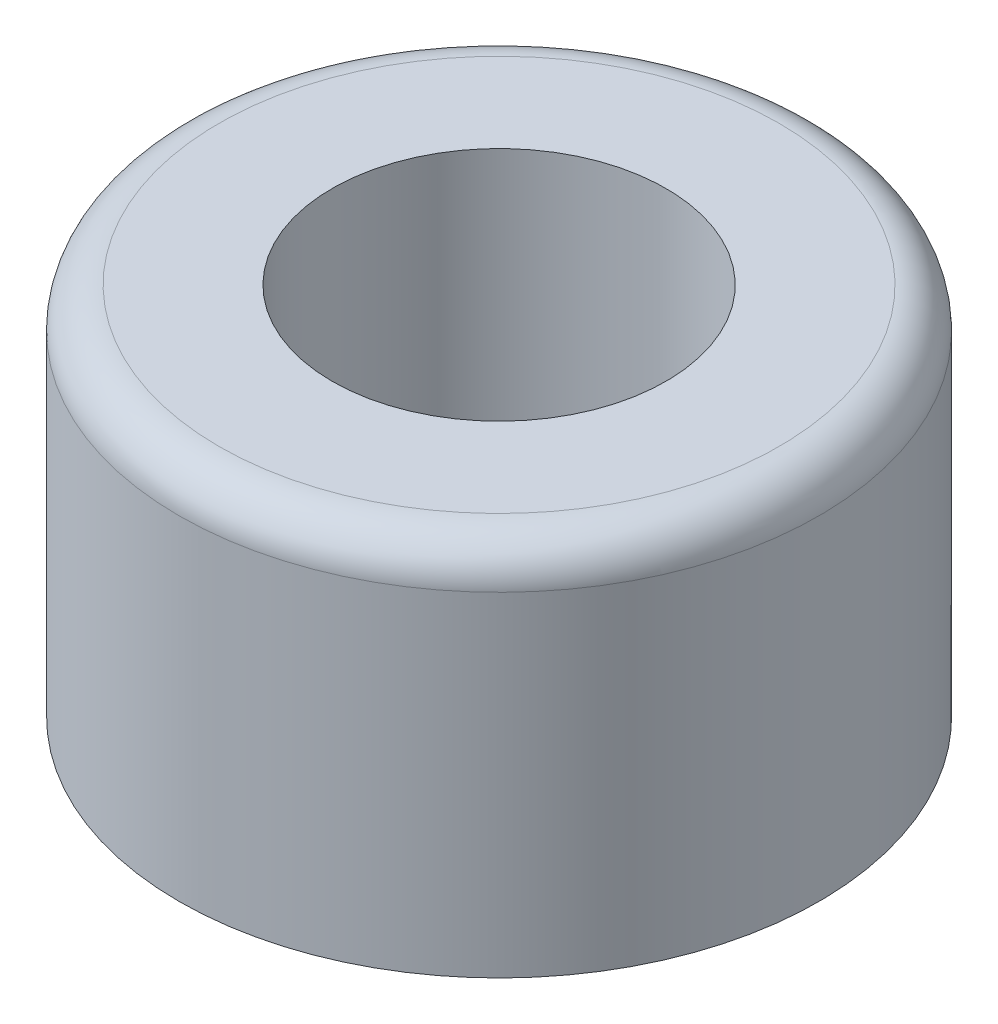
from build123d import *

# Parameters (mm, degrees)
SKETCH1_R      = 4.064
SKETCH1_R_2    = 2.1209
EXTRUDE1_DEPTH = 2.3749
FILLET1_R      = 0.508


with BuildPart() as part:
    # Sketch1 → Extrude1 (new, symmetric)
    with BuildSketch(Plane(origin=(0, 0, 0), x_dir=(1, 0, 0), z_dir=(0, 1, 0))):
        with Locations(Location((0, 0, 0), (0, 0, 270))):
            Circle(SKETCH1_R)
        with Locations(Location((0, 0, 0), (0, 0, 270))):
            Circle(SKETCH1_R_2, mode=Mode.SUBTRACT)
    extrude(amount=EXTRUDE1_DEPTH, both=True)

    # Fillet1
    fillet1_edges = [part.edges().sort_by_distance(p)[0] for p in [
        (0, 2.3749, -4.064),
    ]]
    fillet(fillet1_edges, radius=FILLET1_R)


solid = part.part
